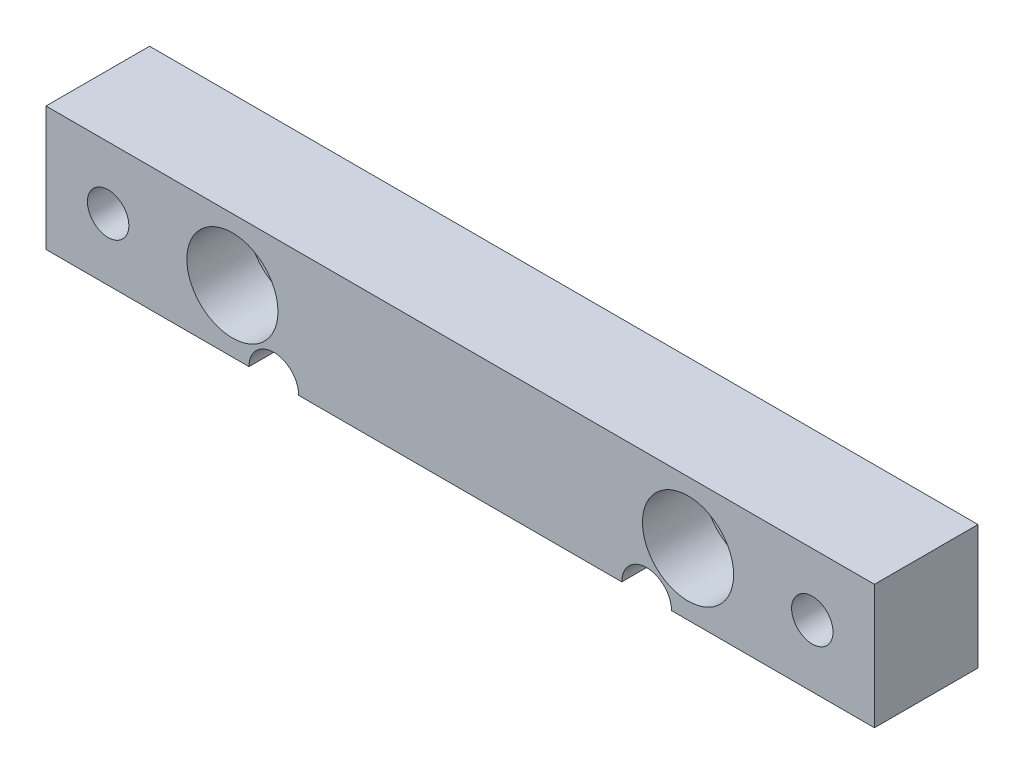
ISO-10303-21;
HEADER;
FILE_DESCRIPTION(('STEP AP214'),'2;1');
FILE_NAME('part.step','',(''),(''),'','','');
FILE_SCHEMA(('AUTOMOTIVE_DESIGN { 1 0 10303 214 1 1 1 1 }'));
ENDSEC;
DATA;
#1=APPLICATION_CONTEXT('core data for automotive mechanical design processes');
#2=APPLICATION_PROTOCOL_DEFINITION('international standard','automotive_design',2000,#1);
#3=PRODUCT_CONTEXT('',#1,'mechanical');
#4=PRODUCT('Part','Part','',(#3));
#5=PRODUCT_RELATED_PRODUCT_CATEGORY('part','',(#4));
#6=PRODUCT_DEFINITION_FORMATION('','',#4);
#7=PRODUCT_DEFINITION_CONTEXT('part definition',#1,'design');
#8=PRODUCT_DEFINITION('design','',#6,#7);
#9=PRODUCT_DEFINITION_SHAPE('','',#8);
#10=(LENGTH_UNIT() NAMED_UNIT(*) SI_UNIT(.MILLI.,.METRE.));
#11=(NAMED_UNIT(*) PLANE_ANGLE_UNIT() SI_UNIT($,.RADIAN.));
#12=(NAMED_UNIT(*) SI_UNIT($,.STERADIAN.) SOLID_ANGLE_UNIT());
#13=UNCERTAINTY_MEASURE_WITH_UNIT(LENGTH_MEASURE(1.E-05),#10,'distance_accuracy_value','');
#14=(GEOMETRIC_REPRESENTATION_CONTEXT(3) GLOBAL_UNCERTAINTY_ASSIGNED_CONTEXT((#13)) GLOBAL_UNIT_ASSIGNED_CONTEXT((#10,
#11,#12)) REPRESENTATION_CONTEXT('',''));
#15=CARTESIAN_POINT('',(0.,0.,0.));
#16=DIRECTION('',(0.,0.,1.));
#17=DIRECTION('',(1.,0.,0.));
#18=AXIS2_PLACEMENT_3D('',#15,#16,#17);
#19=CARTESIAN_POINT('',(-100.,-15.,25.));
#20=DIRECTION('',(0.,1.,0.));
#21=DIRECTION('',(0.,0.,1.));
#22=AXIS2_PLACEMENT_3D('',#19,#20,#21);
#23=PLANE('',#22);
#24=DIRECTION('',(1.,0.,0.));
#25=VECTOR('',#24,1.);
#26=CARTESIAN_POINT('',(-100.,-15.,0.));
#27=LINE('',#26,#25);
#28=CARTESIAN_POINT('',(-39.,-15.,0.));
#29=VERTEX_POINT('',#28);
#30=CARTESIAN_POINT('',(39.,-15.,0.));
#31=VERTEX_POINT('',#30);
#32=EDGE_CURVE('E123',#29,#31,#27,.T.);
#33=ORIENTED_EDGE('',*,*,#32,.T.);
#34=DIRECTION('',(0.,0.,1.));
#35=VECTOR('',#34,1.);
#36=CARTESIAN_POINT('',(39.,-15.,0.));
#37=LINE('',#36,#35);
#38=CARTESIAN_POINT('',(39.,-15.,25.));
#39=VERTEX_POINT('',#38);
#40=EDGE_CURVE('E11',#31,#39,#37,.T.);
#41=ORIENTED_EDGE('',*,*,#40,.T.);
#42=DIRECTION('',(1.,0.,0.));
#43=VECTOR('',#42,1.);
#44=CARTESIAN_POINT('',(-100.,-15.,25.));
#45=LINE('',#44,#43);
#46=CARTESIAN_POINT('',(-39.,-15.,25.));
#47=VERTEX_POINT('',#46);
#48=EDGE_CURVE('E94',#47,#39,#45,.T.);
#49=ORIENTED_EDGE('',*,*,#48,.F.);
#50=DIRECTION('',(0.,0.,1.));
#51=VECTOR('',#50,1.);
#52=CARTESIAN_POINT('',(-39.,-15.,0.));
#53=LINE('',#52,#51);
#54=EDGE_CURVE('E135',#47,#29,#53,.F.);
#55=ORIENTED_EDGE('',*,*,#54,.T.);
#56=EDGE_LOOP('',(#33,#41,#49,#55));
#57=FACE_BOUND('',#56,.T.);
#58=ADVANCED_FACE('F17',(#57),#23,.F.);
#59=CARTESIAN_POINT('',(-100.,-15.,0.));
#60=VERTEX_POINT('',#59);
#61=CARTESIAN_POINT('',(-51.,-15.,0.));
#62=VERTEX_POINT('',#61);
#63=EDGE_CURVE('E119',#60,#62,#27,.T.);
#64=ORIENTED_EDGE('',*,*,#63,.T.);
#65=DIRECTION('',(0.,0.,1.));
#66=VECTOR('',#65,1.);
#67=CARTESIAN_POINT('',(-51.,-15.,0.));
#68=LINE('',#67,#66);
#69=CARTESIAN_POINT('',(-51.,-15.,25.));
#70=VERTEX_POINT('',#69);
#71=EDGE_CURVE('E85',#62,#70,#68,.T.);
#72=ORIENTED_EDGE('',*,*,#71,.T.);
#73=CARTESIAN_POINT('',(-100.,-15.,25.));
#74=VERTEX_POINT('',#73);
#75=EDGE_CURVE('E102',#74,#70,#45,.T.);
#76=ORIENTED_EDGE('',*,*,#75,.F.);
#77=DIRECTION('',(0.,0.,-1.));
#78=VECTOR('',#77,1.);
#79=CARTESIAN_POINT('',(-100.,-15.,25.));
#80=LINE('',#79,#78);
#81=EDGE_CURVE('E132',#74,#60,#80,.T.);
#82=ORIENTED_EDGE('',*,*,#81,.T.);
#83=EDGE_LOOP('',(#64,#72,#76,#82));
#84=FACE_BOUND('',#83,.T.);
#85=ADVANCED_FACE('F139',(#84),#23,.F.);
#86=CARTESIAN_POINT('',(-100.,-15.,25.));
#87=DIRECTION('',(0.,0.,1.));
#88=DIRECTION('',(1.,0.,0.));
#89=AXIS2_PLACEMENT_3D('',#86,#87,#88);
#90=PLANE('',#89);
#91=CARTESIAN_POINT('',(45.,-15.,25.));
#92=DIRECTION('',(0.,0.,1.));
#93=DIRECTION('',(1.,0.,0.));
#94=AXIS2_PLACEMENT_3D('',#91,#92,#93);
#95=CIRCLE('',#94,6.);
#96=CARTESIAN_POINT('',(51.,-15.,25.));
#97=VERTEX_POINT('',#96);
#98=EDGE_CURVE('E81',#97,#39,#95,.T.);
#99=ORIENTED_EDGE('',*,*,#98,.F.);
#100=CARTESIAN_POINT('',(100.,-15.,25.));
#101=VERTEX_POINT('',#100);
#102=EDGE_CURVE('E90',#97,#101,#45,.T.);
#103=ORIENTED_EDGE('',*,*,#102,.T.);
#104=DIRECTION('',(0.,1.,0.));
#105=VECTOR('',#104,1.);
#106=CARTESIAN_POINT('',(100.,15.,25.));
#107=LINE('',#106,#105);
#108=CARTESIAN_POINT('',(100.,15.,25.));
#109=VERTEX_POINT('',#108);
#110=EDGE_CURVE('E108',#101,#109,#107,.T.);
#111=ORIENTED_EDGE('',*,*,#110,.T.);
#112=DIRECTION('',(-1.,0.,0.));
#113=VECTOR('',#112,1.);
#114=CARTESIAN_POINT('',(-100.,15.,25.));
#115=LINE('',#114,#113);
#116=CARTESIAN_POINT('',(-100.,15.,25.));
#117=VERTEX_POINT('',#116);
#118=EDGE_CURVE('E109',#109,#117,#115,.T.);
#119=ORIENTED_EDGE('',*,*,#118,.T.);
#120=DIRECTION('',(0.,-1.,0.));
#121=VECTOR('',#120,1.);
#122=CARTESIAN_POINT('',(-100.,15.,25.));
#123=LINE('',#122,#121);
#124=EDGE_CURVE('E100',#117,#74,#123,.T.);
#125=ORIENTED_EDGE('',*,*,#124,.T.);
#126=ORIENTED_EDGE('',*,*,#75,.T.);
#127=CARTESIAN_POINT('',(-45.,-15.,25.));
#128=DIRECTION('',(0.,0.,1.));
#129=DIRECTION('',(1.,0.,0.));
#130=AXIS2_PLACEMENT_3D('',#127,#128,#129);
#131=CIRCLE('',#130,6.);
#132=EDGE_CURVE('E141',#47,#70,#131,.T.);
#133=ORIENTED_EDGE('',*,*,#132,.F.);
#134=ORIENTED_EDGE('',*,*,#48,.T.);
#135=EDGE_LOOP('',(#99,#103,#111,#119,#125,#126,#133,#134));
#136=FACE_BOUND('',#135,.T.);
#137=CARTESIAN_POINT('',(55.,0.,25.));
#138=DIRECTION('',(0.,0.,1.));
#139=DIRECTION('',(1.,0.,0.));
#140=AXIS2_PLACEMENT_3D('',#137,#138,#139);
#141=CIRCLE('',#140,11.);
#142=CARTESIAN_POINT('',(66.,0.,25.));
#143=VERTEX_POINT('',#142);
#144=EDGE_CURVE('E148',#143,#143,#141,.T.);
#145=ORIENTED_EDGE('',*,*,#144,.F.);
#146=EDGE_LOOP('',(#145));
#147=FACE_BOUND('',#146,.T.);
#148=CARTESIAN_POINT('',(-55.,0.,25.));
#149=DIRECTION('',(0.,0.,1.));
#150=DIRECTION('',(1.,0.,0.));
#151=AXIS2_PLACEMENT_3D('',#148,#149,#150);
#152=CIRCLE('',#151,11.);
#153=CARTESIAN_POINT('',(-44.,0.,25.));
#154=VERTEX_POINT('',#153);
#155=EDGE_CURVE('E164',#154,#154,#152,.T.);
#156=ORIENTED_EDGE('',*,*,#155,.F.);
#157=EDGE_LOOP('',(#156));
#158=FACE_BOUND('',#157,.T.);
#159=CARTESIAN_POINT('',(-85.,0.,25.));
#160=DIRECTION('',(0.,0.,1.));
#161=DIRECTION('',(1.,0.,0.));
#162=AXIS2_PLACEMENT_3D('',#159,#160,#161);
#163=CIRCLE('',#162,5.);
#164=CARTESIAN_POINT('',(-80.,0.,25.));
#165=VERTEX_POINT('',#164);
#166=EDGE_CURVE('E118',#165,#165,#163,.T.);
#167=ORIENTED_EDGE('',*,*,#166,.F.);
#168=EDGE_LOOP('',(#167));
#169=FACE_BOUND('',#168,.T.);
#170=CARTESIAN_POINT('',(85.,0.,25.));
#171=DIRECTION('',(0.,0.,1.));
#172=DIRECTION('',(-1.,0.,0.));
#173=AXIS2_PLACEMENT_3D('',#170,#171,#172);
#174=CIRCLE('',#173,5.);
#175=CARTESIAN_POINT('',(80.,0.,25.));
#176=VERTEX_POINT('',#175);
#177=EDGE_CURVE('E177',#176,#176,#174,.T.);
#178=ORIENTED_EDGE('',*,*,#177,.F.);
#179=EDGE_LOOP('',(#178));
#180=FACE_BOUND('',#179,.T.);
#181=ADVANCED_FACE('F88',(#136,#147,#158,#169,#180),#90,.T.);
#182=CARTESIAN_POINT('',(-100.,-15.,0.));
#183=DIRECTION('',(0.,0.,1.));
#184=DIRECTION('',(1.,0.,0.));
#185=AXIS2_PLACEMENT_3D('',#182,#183,#184);
#186=PLANE('',#185);
#187=CARTESIAN_POINT('',(55.,0.,0.));
#188=DIRECTION('',(0.,0.,1.));
#189=DIRECTION('',(1.,0.,0.));
#190=AXIS2_PLACEMENT_3D('',#187,#188,#189);
#191=CIRCLE('',#190,6.5);
#192=CARTESIAN_POINT('',(61.5,0.,0.));
#193=VERTEX_POINT('',#192);
#194=EDGE_CURVE('E161',#193,#193,#191,.T.);
#195=ORIENTED_EDGE('',*,*,#194,.T.);
#196=EDGE_LOOP('',(#195));
#197=FACE_BOUND('',#196,.T.);
#198=CARTESIAN_POINT('',(-55.,0.,0.));
#199=DIRECTION('',(0.,0.,1.));
#200=DIRECTION('',(1.,0.,0.));
#201=AXIS2_PLACEMENT_3D('',#198,#199,#200);
#202=CIRCLE('',#201,6.5);
#203=CARTESIAN_POINT('',(-48.5,0.,0.));
#204=VERTEX_POINT('',#203);
#205=EDGE_CURVE('E173',#204,#204,#202,.T.);
#206=ORIENTED_EDGE('',*,*,#205,.T.);
#207=EDGE_LOOP('',(#206));
#208=FACE_BOUND('',#207,.T.);
#209=CARTESIAN_POINT('',(-85.,0.,0.));
#210=DIRECTION('',(0.,0.,1.));
#211=DIRECTION('',(1.,0.,0.));
#212=AXIS2_PLACEMENT_3D('',#209,#210,#211);
#213=CIRCLE('',#212,5.);
#214=CARTESIAN_POINT('',(-80.,0.,0.));
#215=VERTEX_POINT('',#214);
#216=EDGE_CURVE('E180',#215,#215,#213,.T.);
#217=ORIENTED_EDGE('',*,*,#216,.T.);
#218=EDGE_LOOP('',(#217));
#219=FACE_BOUND('',#218,.T.);
#220=CARTESIAN_POINT('',(51.,-15.,0.));
#221=VERTEX_POINT('',#220);
#222=CARTESIAN_POINT('',(100.,-15.,0.));
#223=VERTEX_POINT('',#222);
#224=EDGE_CURVE('E117',#221,#223,#27,.T.);
#225=ORIENTED_EDGE('',*,*,#224,.F.);
#226=CARTESIAN_POINT('',(45.,-15.,0.));
#227=DIRECTION('',(0.,0.,1.));
#228=DIRECTION('',(1.,0.,0.));
#229=AXIS2_PLACEMENT_3D('',#226,#227,#228);
#230=CIRCLE('',#229,6.);
#231=EDGE_CURVE('E32',#221,#31,#230,.T.);
#232=ORIENTED_EDGE('',*,*,#231,.T.);
#233=ORIENTED_EDGE('',*,*,#32,.F.);
#234=CARTESIAN_POINT('',(-45.,-15.,0.));
#235=DIRECTION('',(0.,0.,1.));
#236=DIRECTION('',(1.,0.,0.));
#237=AXIS2_PLACEMENT_3D('',#234,#235,#236);
#238=CIRCLE('',#237,6.);
#239=EDGE_CURVE('E40',#29,#62,#238,.T.);
#240=ORIENTED_EDGE('',*,*,#239,.T.);
#241=ORIENTED_EDGE('',*,*,#63,.F.);
#242=DIRECTION('',(0.,-1.,0.));
#243=VECTOR('',#242,1.);
#244=CARTESIAN_POINT('',(-100.,15.,0.));
#245=LINE('',#244,#243);
#246=CARTESIAN_POINT('',(-100.,15.,0.));
#247=VERTEX_POINT('',#246);
#248=EDGE_CURVE('E114',#247,#60,#245,.T.);
#249=ORIENTED_EDGE('',*,*,#248,.F.);
#250=DIRECTION('',(-1.,0.,0.));
#251=VECTOR('',#250,1.);
#252=CARTESIAN_POINT('',(-100.,15.,0.));
#253=LINE('',#252,#251);
#254=CARTESIAN_POINT('',(100.,15.,0.));
#255=VERTEX_POINT('',#254);
#256=EDGE_CURVE('E104',#255,#247,#253,.T.);
#257=ORIENTED_EDGE('',*,*,#256,.F.);
#258=DIRECTION('',(0.,1.,0.));
#259=VECTOR('',#258,1.);
#260=CARTESIAN_POINT('',(100.,15.,0.));
#261=LINE('',#260,#259);
#262=EDGE_CURVE('E122',#223,#255,#261,.T.);
#263=ORIENTED_EDGE('',*,*,#262,.F.);
#264=EDGE_LOOP('',(#225,#232,#233,#240,#241,#249,#257,#263));
#265=FACE_BOUND('',#264,.T.);
#266=CARTESIAN_POINT('',(85.,0.,0.));
#267=DIRECTION('',(0.,0.,1.));
#268=DIRECTION('',(-1.,0.,0.));
#269=AXIS2_PLACEMENT_3D('',#266,#267,#268);
#270=CIRCLE('',#269,5.);
#271=CARTESIAN_POINT('',(80.,0.,0.));
#272=VERTEX_POINT('',#271);
#273=EDGE_CURVE('E176',#272,#272,#270,.T.);
#274=ORIENTED_EDGE('',*,*,#273,.T.);
#275=EDGE_LOOP('',(#274));
#276=FACE_BOUND('',#275,.T.);
#277=ADVANCED_FACE('F144',(#197,#208,#219,#265,#276),#186,.F.);
#278=CARTESIAN_POINT('',(-100.,15.,25.));
#279=DIRECTION('',(1.,0.,0.));
#280=DIRECTION('',(0.,0.,-1.));
#281=AXIS2_PLACEMENT_3D('',#278,#279,#280);
#282=PLANE('',#281);
#283=ORIENTED_EDGE('',*,*,#248,.T.);
#284=ORIENTED_EDGE('',*,*,#81,.F.);
#285=ORIENTED_EDGE('',*,*,#124,.F.);
#286=DIRECTION('',(0.,0.,-1.));
#287=VECTOR('',#286,1.);
#288=CARTESIAN_POINT('',(-100.,15.,25.));
#289=LINE('',#288,#287);
#290=EDGE_CURVE('E111',#117,#247,#289,.T.);
#291=ORIENTED_EDGE('',*,*,#290,.T.);
#292=EDGE_LOOP('',(#283,#284,#285,#291));
#293=FACE_BOUND('',#292,.T.);
#294=ADVANCED_FACE('F19',(#293),#282,.F.);
#295=ORIENTED_EDGE('',*,*,#102,.F.);
#296=DIRECTION('',(0.,0.,1.));
#297=VECTOR('',#296,1.);
#298=CARTESIAN_POINT('',(51.,-15.,0.));
#299=LINE('',#298,#297);
#300=EDGE_CURVE('E25',#97,#221,#299,.F.);
#301=ORIENTED_EDGE('',*,*,#300,.T.);
#302=ORIENTED_EDGE('',*,*,#224,.T.);
#303=DIRECTION('',(0.,0.,-1.));
#304=VECTOR('',#303,1.);
#305=CARTESIAN_POINT('',(100.,-15.,25.));
#306=LINE('',#305,#304);
#307=EDGE_CURVE('E98',#101,#223,#306,.T.);
#308=ORIENTED_EDGE('',*,*,#307,.F.);
#309=EDGE_LOOP('',(#295,#301,#302,#308));
#310=FACE_BOUND('',#309,.T.);
#311=ADVANCED_FACE('F96',(#310),#23,.F.);
#312=CARTESIAN_POINT('',(100.,15.,25.));
#313=DIRECTION('',(-1.,0.,0.));
#314=DIRECTION('',(0.,0.,1.));
#315=AXIS2_PLACEMENT_3D('',#312,#313,#314);
#316=PLANE('',#315);
#317=ORIENTED_EDGE('',*,*,#262,.T.);
#318=DIRECTION('',(0.,0.,-1.));
#319=VECTOR('',#318,1.);
#320=CARTESIAN_POINT('',(100.,15.,25.));
#321=LINE('',#320,#319);
#322=EDGE_CURVE('E128',#109,#255,#321,.T.);
#323=ORIENTED_EDGE('',*,*,#322,.F.);
#324=ORIENTED_EDGE('',*,*,#110,.F.);
#325=ORIENTED_EDGE('',*,*,#307,.T.);
#326=EDGE_LOOP('',(#317,#323,#324,#325));
#327=FACE_BOUND('',#326,.T.);
#328=ADVANCED_FACE('F204',(#327),#316,.F.);
#329=CARTESIAN_POINT('',(-100.,15.,25.));
#330=DIRECTION('',(0.,-1.,0.));
#331=DIRECTION('',(0.,0.,-1.));
#332=AXIS2_PLACEMENT_3D('',#329,#330,#331);
#333=PLANE('',#332);
#334=ORIENTED_EDGE('',*,*,#256,.T.);
#335=ORIENTED_EDGE('',*,*,#290,.F.);
#336=ORIENTED_EDGE('',*,*,#118,.F.);
#337=ORIENTED_EDGE('',*,*,#322,.T.);
#338=EDGE_LOOP('',(#334,#335,#336,#337));
#339=FACE_BOUND('',#338,.T.);
#340=ADVANCED_FACE('F192',(#339),#333,.F.);
#341=CARTESIAN_POINT('',(-85.,0.,25.));
#342=DIRECTION('',(0.,0.,-1.));
#343=DIRECTION('',(-1.,0.,0.));
#344=AXIS2_PLACEMENT_3D('',#341,#342,#343);
#345=CYLINDRICAL_SURFACE('',#344,5.);
#346=ORIENTED_EDGE('',*,*,#166,.T.);
#347=EDGE_LOOP('',(#346));
#348=FACE_BOUND('',#347,.T.);
#349=ORIENTED_EDGE('',*,*,#216,.F.);
#350=EDGE_LOOP('',(#349));
#351=FACE_BOUND('',#350,.T.);
#352=ADVANCED_FACE('F189',(#348,#351),#345,.F.);
#353=CARTESIAN_POINT('',(85.,0.,25.));
#354=DIRECTION('',(0.,0.,-1.));
#355=DIRECTION('',(-1.,0.,0.));
#356=AXIS2_PLACEMENT_3D('',#353,#354,#355);
#357=CYLINDRICAL_SURFACE('',#356,5.);
#358=ORIENTED_EDGE('',*,*,#177,.T.);
#359=EDGE_LOOP('',(#358));
#360=FACE_BOUND('',#359,.T.);
#361=ORIENTED_EDGE('',*,*,#273,.F.);
#362=EDGE_LOOP('',(#361));
#363=FACE_BOUND('',#362,.T.);
#364=ADVANCED_FACE('F191',(#360,#363),#357,.F.);
#365=CARTESIAN_POINT('',(-55.,0.,25.));
#366=DIRECTION('',(0.,0.,1.));
#367=DIRECTION('',(1.,0.,0.));
#368=AXIS2_PLACEMENT_3D('',#365,#366,#367);
#369=CYLINDRICAL_SURFACE('',#368,6.5);
#370=ORIENTED_EDGE('',*,*,#205,.F.);
#371=EDGE_LOOP('',(#370));
#372=FACE_BOUND('',#371,.T.);
#373=CARTESIAN_POINT('',(-55.,0.,10.));
#374=DIRECTION('',(0.,0.,1.));
#375=DIRECTION('',(1.,0.,0.));
#376=AXIS2_PLACEMENT_3D('',#373,#374,#375);
#377=CIRCLE('',#376,6.5);
#378=CARTESIAN_POINT('',(-48.5,0.,10.));
#379=VERTEX_POINT('',#378);
#380=EDGE_CURVE('E170',#379,#379,#377,.T.);
#381=ORIENTED_EDGE('',*,*,#380,.T.);
#382=EDGE_LOOP('',(#381));
#383=FACE_BOUND('',#382,.T.);
#384=ADVANCED_FACE('F201',(#372,#383),#369,.F.);
#385=CARTESIAN_POINT('',(-48.5,0.,10.));
#386=DIRECTION('',(0.,0.,-1.));
#387=DIRECTION('',(-1.,0.,0.));
#388=AXIS2_PLACEMENT_3D('',#385,#386,#387);
#389=PLANE('',#388);
#390=ORIENTED_EDGE('',*,*,#380,.F.);
#391=EDGE_LOOP('',(#390));
#392=FACE_BOUND('',#391,.T.);
#393=CARTESIAN_POINT('',(-55.,0.,10.));
#394=DIRECTION('',(0.,0.,1.));
#395=DIRECTION('',(1.,0.,0.));
#396=AXIS2_PLACEMENT_3D('',#393,#394,#395);
#397=CIRCLE('',#396,11.);
#398=CARTESIAN_POINT('',(-44.,0.,10.));
#399=VERTEX_POINT('',#398);
#400=EDGE_CURVE('E167',#399,#399,#397,.T.);
#401=ORIENTED_EDGE('',*,*,#400,.T.);
#402=EDGE_LOOP('',(#401));
#403=FACE_BOUND('',#402,.T.);
#404=ADVANCED_FACE('F245',(#392,#403),#389,.F.);
#405=CARTESIAN_POINT('',(-55.,0.,25.));
#406=DIRECTION('',(0.,0.,1.));
#407=DIRECTION('',(1.,0.,0.));
#408=AXIS2_PLACEMENT_3D('',#405,#406,#407);
#409=CYLINDRICAL_SURFACE('',#408,11.);
#410=ORIENTED_EDGE('',*,*,#400,.F.);
#411=EDGE_LOOP('',(#410));
#412=FACE_BOUND('',#411,.T.);
#413=ORIENTED_EDGE('',*,*,#155,.T.);
#414=EDGE_LOOP('',(#413));
#415=FACE_BOUND('',#414,.T.);
#416=ADVANCED_FACE('F251',(#412,#415),#409,.F.);
#417=CARTESIAN_POINT('',(55.,0.,25.));
#418=DIRECTION('',(0.,0.,1.));
#419=DIRECTION('',(1.,0.,0.));
#420=AXIS2_PLACEMENT_3D('',#417,#418,#419);
#421=CYLINDRICAL_SURFACE('',#420,6.5);
#422=ORIENTED_EDGE('',*,*,#194,.F.);
#423=EDGE_LOOP('',(#422));
#424=FACE_BOUND('',#423,.T.);
#425=CARTESIAN_POINT('',(55.,0.,10.));
#426=DIRECTION('',(0.,0.,1.));
#427=DIRECTION('',(1.,0.,0.));
#428=AXIS2_PLACEMENT_3D('',#425,#426,#427);
#429=CIRCLE('',#428,6.5);
#430=CARTESIAN_POINT('',(61.5,0.,10.));
#431=VERTEX_POINT('',#430);
#432=EDGE_CURVE('E158',#431,#431,#429,.T.);
#433=ORIENTED_EDGE('',*,*,#432,.T.);
#434=EDGE_LOOP('',(#433));
#435=FACE_BOUND('',#434,.T.);
#436=ADVANCED_FACE('F257',(#424,#435),#421,.F.);
#437=CARTESIAN_POINT('',(61.5,0.,10.));
#438=DIRECTION('',(0.,0.,-1.));
#439=DIRECTION('',(-1.,0.,0.));
#440=AXIS2_PLACEMENT_3D('',#437,#438,#439);
#441=PLANE('',#440);
#442=ORIENTED_EDGE('',*,*,#432,.F.);
#443=EDGE_LOOP('',(#442));
#444=FACE_BOUND('',#443,.T.);
#445=CARTESIAN_POINT('',(55.,0.,10.));
#446=DIRECTION('',(0.,0.,1.));
#447=DIRECTION('',(1.,0.,0.));
#448=AXIS2_PLACEMENT_3D('',#445,#446,#447);
#449=CIRCLE('',#448,11.);
#450=CARTESIAN_POINT('',(66.,0.,10.));
#451=VERTEX_POINT('',#450);
#452=EDGE_CURVE('E151',#451,#451,#449,.T.);
#453=ORIENTED_EDGE('',*,*,#452,.T.);
#454=EDGE_LOOP('',(#453));
#455=FACE_BOUND('',#454,.T.);
#456=ADVANCED_FACE('F271',(#444,#455),#441,.F.);
#457=CARTESIAN_POINT('',(55.,0.,25.));
#458=DIRECTION('',(0.,0.,1.));
#459=DIRECTION('',(1.,0.,0.));
#460=AXIS2_PLACEMENT_3D('',#457,#458,#459);
#461=CYLINDRICAL_SURFACE('',#460,11.);
#462=ORIENTED_EDGE('',*,*,#452,.F.);
#463=EDGE_LOOP('',(#462));
#464=FACE_BOUND('',#463,.T.);
#465=ORIENTED_EDGE('',*,*,#144,.T.);
#466=EDGE_LOOP('',(#465));
#467=FACE_BOUND('',#466,.T.);
#468=ADVANCED_FACE('F277',(#464,#467),#461,.F.);
#469=CARTESIAN_POINT('',(-45.,-15.,0.));
#470=DIRECTION('',(0.,0.,1.));
#471=DIRECTION('',(1.,0.,0.));
#472=AXIS2_PLACEMENT_3D('',#469,#470,#471);
#473=CYLINDRICAL_SURFACE('',#472,6.);
#474=ORIENTED_EDGE('',*,*,#239,.F.);
#475=ORIENTED_EDGE('',*,*,#54,.F.);
#476=ORIENTED_EDGE('',*,*,#132,.T.);
#477=ORIENTED_EDGE('',*,*,#71,.F.);
#478=EDGE_LOOP('',(#474,#475,#476,#477));
#479=FACE_BOUND('',#478,.T.);
#480=ADVANCED_FACE('F140',(#479),#473,.F.);
#481=CARTESIAN_POINT('',(45.,-15.,0.));
#482=DIRECTION('',(0.,0.,1.));
#483=DIRECTION('',(1.,0.,0.));
#484=AXIS2_PLACEMENT_3D('',#481,#482,#483);
#485=CYLINDRICAL_SURFACE('',#484,6.);
#486=ORIENTED_EDGE('',*,*,#231,.F.);
#487=ORIENTED_EDGE('',*,*,#300,.F.);
#488=ORIENTED_EDGE('',*,*,#98,.T.);
#489=ORIENTED_EDGE('',*,*,#40,.F.);
#490=EDGE_LOOP('',(#486,#487,#488,#489));
#491=FACE_BOUND('',#490,.T.);
#492=ADVANCED_FACE('F80',(#491),#485,.F.);
#493=CLOSED_SHELL('',(#58,#85,#181,#277,#294,#311,#328,#340,#352,#364,#384,#404,#416,#436,#456,
#468,#480,#492));
#494=MANIFOLD_SOLID_BREP('B1',#493);
#495=ADVANCED_BREP_SHAPE_REPRESENTATION('',(#18,#494),#14);
#496=SHAPE_DEFINITION_REPRESENTATION(#9,#495);
ENDSEC;
END-ISO-10303-21;
